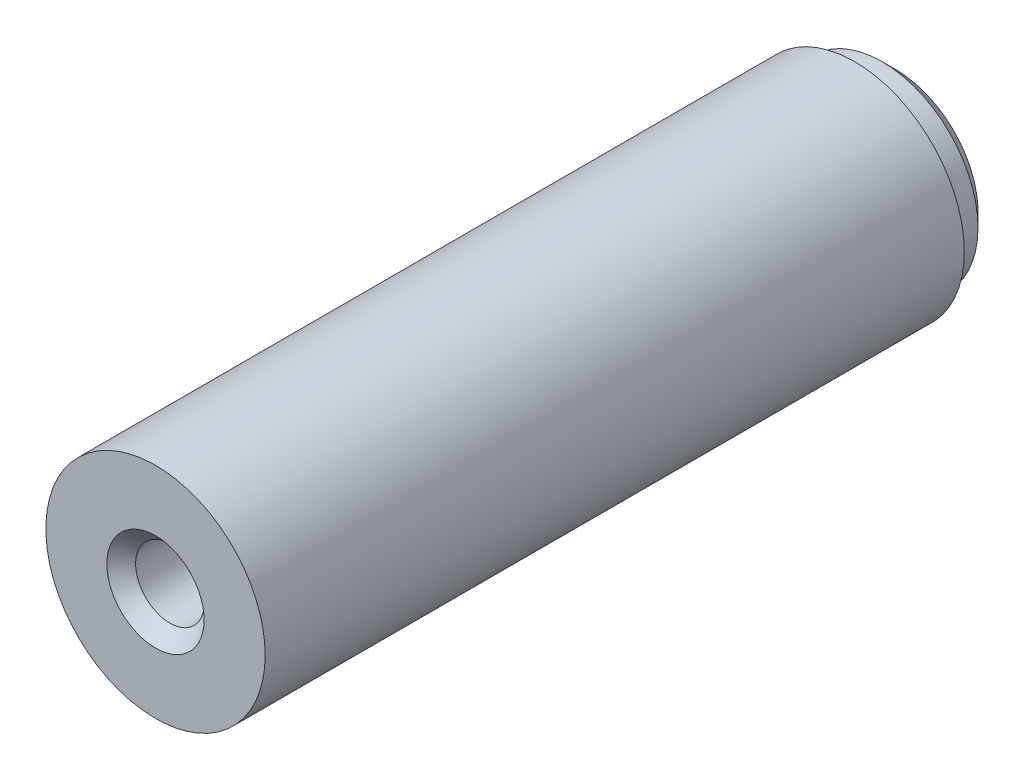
from build123d import *

# Parameters (mm, degrees)
SKICA1_R                = 4
P_IDAT_VYSUNUT_M1_DEPTH = 25.5
M3_Z_VIT1_D             = 2.5
M3_Z_VIT1_DEPTH         = 15
M3_Z_VIT1_CSINK_D       = 3.55
M3_Z_VIT1_CSINK_ANGLE   = 90
M3_Z_VIT1_TIP           = 0.751075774
SKICA4_R                = 3.5
P_IDAT_VYSUNUT_M2_DEPTH = 1.5
ZKOSEN_1_SIZE           = 0.5


with BuildPart() as part:
    # Skica1 → P_idat vysunut_m1 (new body)
    with BuildSketch(Plane.XY):
        Circle(SKICA1_R)
    extrude(amount=P_IDAT_VYSUNUT_M1_DEPTH)

    # M3 z_vit1
    with Locations(Plane.XY.offset(25.5)):
        with Locations((0, 0)):
            CounterSinkHole(M3_Z_VIT1_D / 2, M3_Z_VIT1_CSINK_D / 2, depth=M3_Z_VIT1_DEPTH, counter_sink_angle=M3_Z_VIT1_CSINK_ANGLE)
            with Locations((0, 0, -(M3_Z_VIT1_DEPTH + M3_Z_VIT1_TIP / 2))):  # 118° drill point
                Cone(0, M3_Z_VIT1_D / 2, M3_Z_VIT1_TIP, mode=Mode.SUBTRACT)

    # Skica4 → P_idat vysunut_m2 (add)
    with BuildSketch(Plane(origin=(0, 0, 0), x_dir=(-1, 0, 0), z_dir=(0, 0, -1))):
        with Locations(Location((0, 0, 0), (0, 0, 180))):
            Circle(SKICA4_R)
    extrude(amount=P_IDAT_VYSUNUT_M2_DEPTH)

    # Zkosen_1
    zkosen_1_edges = [part.edges().sort_by_distance(p)[0] for p in [
        (-3.5, 0, -1.5),
    ]]
    chamfer(zkosen_1_edges, length=ZKOSEN_1_SIZE)


solid = part.part
